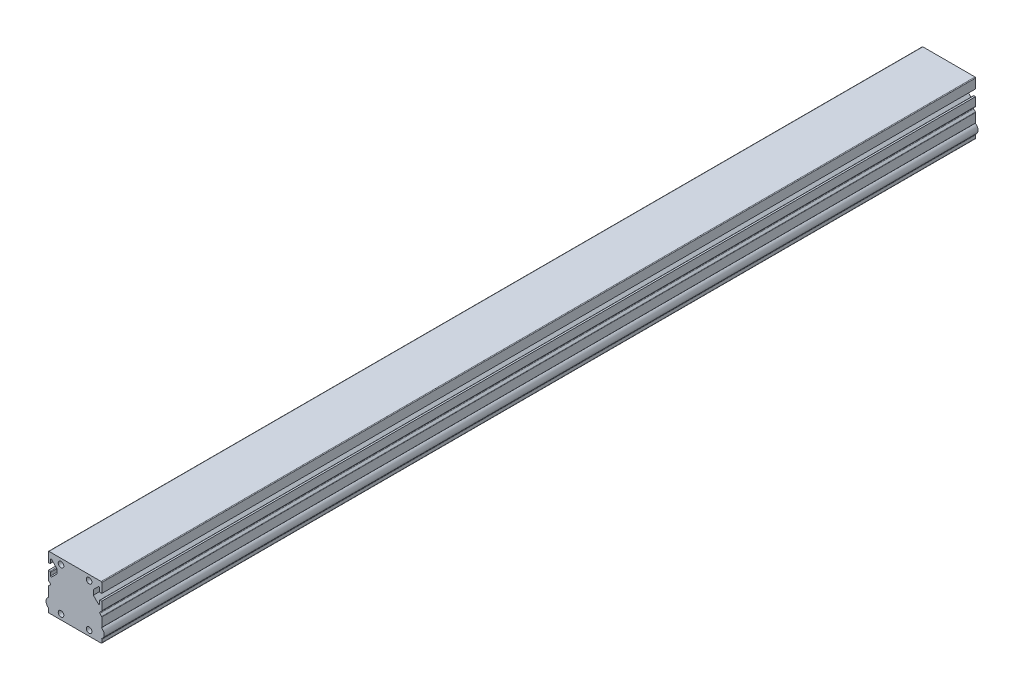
from build123d import *

# Parameters (mm, degrees)
SKIZZE1_W                        = 40
SKIZZE1_H                        = 40
LINEAR_AUSTRAGEN1_DEPTH          = 654
SCHNITT_LINEAR_AUSTRAGEN3_DEPTH  = 655.611335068
SCHNITT_LINEAR_AUSTRAGEN4_DEPTH  = 655.611335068
SCHNITT_LINEAR_AUSTRAGEN5_DEPTH  = 655.611335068
F_4_2_4_2_DURCHMESSER_BOHRUNG1_D = 4.2
VERRUNDUNG1_R                    = 0.3
VERRUNDUNG2_R                    = 0.5
VERRUNDUNG3_R                    = 0.5
SKIZZE9_R                        = 4.05
LINEAR_AUSTRAGEN2_DEPTH          = 654


with BuildPart() as part:
    # Skizze1 → Linear austragen1 (new body)
    with BuildSketch(Plane.XY):
        Rectangle(SKIZZE1_W, SKIZZE1_H)
    extrude(amount=LINEAR_AUSTRAGEN1_DEPTH)

    # Skizze4 → Schnitt-Linear austragen3 (cut, through all)
    with BuildSketch(Plane(origin=(0, 0, 0), x_dir=(-1, 0, 0), z_dir=(0, 0, -1))):
        with BuildLine():
            Line((20, -10.06645834), (20, -16.73354166))
            ThreePointArc((20, -16.73354166), (13.65, -13.4), (20, -10.06645834))
        make_face()
    schnitt_linear_austragen3 = extrude(amount=-SCHNITT_LINEAR_AUSTRAGEN3_DEPTH, mode=Mode.SUBTRACT)

    # Skizze5 → Schnitt-Linear austragen4 (cut, through all)
    with BuildSketch(Plane(origin=(0, 0, 0), x_dir=(-1, 0, 0), z_dir=(0, 0, -1))):
        with BuildLine():
            Line((20, 12.5), (20, 7.5))
            Line((20, 7.5), (18.8, 7.5))
            ThreePointArc((18.8, 7.5), (18.446446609, 7.353553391), (18.3, 7))
            Line((18.3, 7), (18.3, 4.75))
            ThreePointArc((18.3, 4.75), (17.991341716, 4.288060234), (17.446446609, 4.396446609))
            Line((17.446446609, 4.396446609), (13.7, 8.142893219))
            Line((13.7, 8.142893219), (13.7, 11.857106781))
            Line((13.7, 11.857106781), (17.446446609, 15.603553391))
            ThreePointArc((17.446446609, 15.603553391), (17.991341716, 15.711939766), (18.3, 15.25))
            Line((18.3, 15.25), (18.3, 13))
            ThreePointArc((18.3, 13), (18.446446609, 12.646446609), (18.8, 12.5))
            Line((18.8, 12.5), (20, 12.5))
        make_face()
    schnitt_linear_austragen4 = extrude(amount=-SCHNITT_LINEAR_AUSTRAGEN4_DEPTH, mode=Mode.SUBTRACT)

    # Skizze8 → Schnitt-Linear austragen5 (cut, through all)
    with BuildSketch(Plane(origin=(0, 0, 0), x_dir=(-1, 0, 0), z_dir=(0, 0, -1))):
        with BuildLine():
            Line((20, -2.648528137), (18.575735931, -1.224264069))
            ThreePointArc((18.575735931, -1.224264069), (18.4, -0.8), (18.575735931, -0.375735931))
            Line((18.575735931, -0.375735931), (20, 1.048528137))
            Line((20, 1.048528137), (20, -2.648528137))
        make_face()
    schnitt_linear_austragen5 = extrude(amount=-SCHNITT_LINEAR_AUSTRAGEN5_DEPTH, mode=Mode.SUBTRACT)

    # 4.2 _4.2_ Durchmesser Bohrung1 (through all)
    with Locations(Plane(origin=(0, 0, 0), x_dir=(-1, 0, 0), z_dir=(0, 0, -1))):
        with Locations((10.5, -16), (10.5, 16)):
            f_4_2_4_2_durchmesser_bohrung1 = Hole(F_4_2_4_2_DURCHMESSER_BOHRUNG1_D / 2)

    # Spiegeln1: Schnitt-Linear austragen3, Schnitt-Linear austragen4, Schnitt-Linear austragen5, 4.2 _4.2_ Durchmesser Bohrung1 across plane
    add(schnitt_linear_austragen3.mirror(Plane(origin=(0, 0, 0), x_dir=(0, 0, 1), z_dir=(1, 0, 0))), mode=Mode.SUBTRACT)
    add(schnitt_linear_austragen4.mirror(Plane(origin=(0, 0, 0), x_dir=(0, 0, 1), z_dir=(1, 0, 0))), mode=Mode.SUBTRACT)
    add(schnitt_linear_austragen5.mirror(Plane(origin=(0, 0, 0), x_dir=(0, 0, 1), z_dir=(1, 0, 0))), mode=Mode.SUBTRACT)
    add(f_4_2_4_2_durchmesser_bohrung1.mirror(Plane(origin=(0, 0, 0), x_dir=(0, 0, 1), z_dir=(1, 0, 0))), mode=Mode.SUBTRACT)

    # Verrundung1
    verrundung1_edges = [part.edges().sort_by_distance(p)[0] for p in [
        (-20, -16.73354166, 327),
        (-20, -10.06645834, 327),
        (20, -10.06645834, 327),
        (20, -16.73354166, 327),
    ]]
    fillet(verrundung1_edges, radius=VERRUNDUNG1_R)

    # Verrundung2
    verrundung2_edges = [part.edges().sort_by_distance(p)[0] for p in [
        (-20, 20, 327),
        (20, 20, 327),
        (20, -20, 327),
        (-20, -20, 327),
    ]]
    fillet(verrundung2_edges, radius=VERRUNDUNG2_R)

    # Verrundung3
    verrundung3_edges = [part.edges().sort_by_distance(p)[0] for p in [
        (20, -2.648528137, 327),
        (20, 1.048528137, 327),
        (-20, 1.048528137, 327),
        (-20, -2.648528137, 327),
    ]]
    fillet(verrundung3_edges, radius=VERRUNDUNG3_R)

    # Skizze9 → Linear austragen2 (add)
    with BuildSketch(Plane(origin=(0, 0, 0), x_dir=(-1, 0, 0), z_dir=(0, 0, -1))):
        with Locations((-17.7, -13.4)):
            Circle(SKIZZE9_R)
        with Locations((17.7, -13.4)):
            Circle(SKIZZE9_R)
    extrude(amount=-LINEAR_AUSTRAGEN2_DEPTH)


solid = part.part
